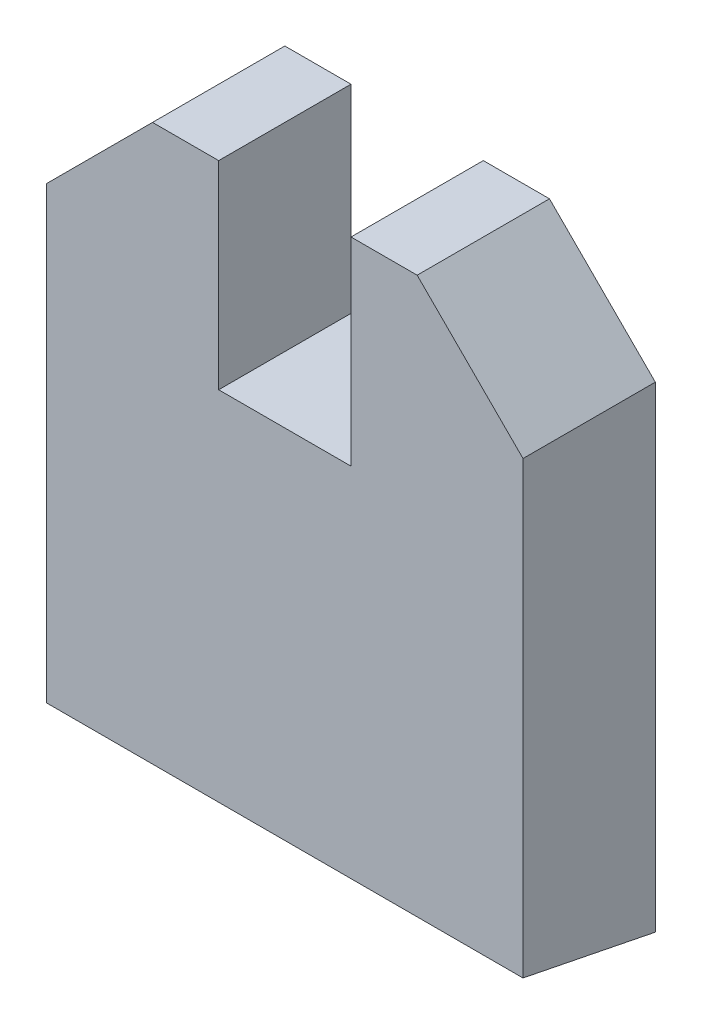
ISO-10303-21;
HEADER;
FILE_DESCRIPTION(('STEP AP214'),'2;1');
FILE_NAME('part.step','',(''),(''),'','','');
FILE_SCHEMA(('AUTOMOTIVE_DESIGN { 1 0 10303 214 1 1 1 1 }'));
ENDSEC;
DATA;
#1=APPLICATION_CONTEXT('core data for automotive mechanical design processes');
#2=APPLICATION_PROTOCOL_DEFINITION('international standard','automotive_design',2000,#1);
#3=PRODUCT_CONTEXT('',#1,'mechanical');
#4=PRODUCT('Part','Part','',(#3));
#5=PRODUCT_RELATED_PRODUCT_CATEGORY('part','',(#4));
#6=PRODUCT_DEFINITION_FORMATION('','',#4);
#7=PRODUCT_DEFINITION_CONTEXT('part definition',#1,'design');
#8=PRODUCT_DEFINITION('design','',#6,#7);
#9=PRODUCT_DEFINITION_SHAPE('','',#8);
#10=(LENGTH_UNIT() NAMED_UNIT(*) SI_UNIT(.MILLI.,.METRE.));
#11=(NAMED_UNIT(*) PLANE_ANGLE_UNIT() SI_UNIT($,.RADIAN.));
#12=(NAMED_UNIT(*) SI_UNIT($,.STERADIAN.) SOLID_ANGLE_UNIT());
#13=UNCERTAINTY_MEASURE_WITH_UNIT(LENGTH_MEASURE(1.E-05),#10,'distance_accuracy_value','');
#14=(GEOMETRIC_REPRESENTATION_CONTEXT(3) GLOBAL_UNCERTAINTY_ASSIGNED_CONTEXT((#13)) GLOBAL_UNIT_ASSIGNED_CONTEXT((#10,
#11,#12)) REPRESENTATION_CONTEXT('',''));
#15=CARTESIAN_POINT('',(0.,0.,0.));
#16=DIRECTION('',(0.,0.,1.));
#17=DIRECTION('',(1.,0.,0.));
#18=AXIS2_PLACEMENT_3D('',#15,#16,#17);
#19=CARTESIAN_POINT('',(9.,0.,5.));
#20=DIRECTION('',(-1.,0.,0.));
#21=DIRECTION('',(0.,-1.,0.));
#22=AXIS2_PLACEMENT_3D('',#19,#20,#21);
#23=PLANE('',#22);
#24=DIRECTION('',(0.,1.,0.));
#25=VECTOR('',#24,1.);
#26=CARTESIAN_POINT('',(9.,0.,5.));
#27=LINE('',#26,#25);
#28=CARTESIAN_POINT('',(9.,1.,5.));
#29=VERTEX_POINT('',#28);
#30=CARTESIAN_POINT('',(9.,18.,5.));
#31=VERTEX_POINT('',#30);
#32=EDGE_CURVE('E94',#29,#31,#27,.T.);
#33=ORIENTED_EDGE('',*,*,#32,.F.);
#34=DIRECTION('',(0.,0.196116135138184,0.98058067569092));
#35=VECTOR('',#34,1.);
#36=CARTESIAN_POINT('',(9.,0.,0.));
#37=LINE('',#36,#35);
#38=CARTESIAN_POINT('',(9.,0.,0.));
#39=VERTEX_POINT('',#38);
#40=EDGE_CURVE('E197',#39,#29,#37,.T.);
#41=ORIENTED_EDGE('',*,*,#40,.F.);
#42=DIRECTION('',(0.,1.,0.));
#43=VECTOR('',#42,1.);
#44=CARTESIAN_POINT('',(9.,0.,0.));
#45=LINE('',#44,#43);
#46=CARTESIAN_POINT('',(9.,18.,0.));
#47=VERTEX_POINT('',#46);
#48=EDGE_CURVE('E141',#39,#47,#45,.T.);
#49=ORIENTED_EDGE('',*,*,#48,.T.);
#50=DIRECTION('',(0.,0.,-1.));
#51=VECTOR('',#50,1.);
#52=CARTESIAN_POINT('',(9.,18.,5.));
#53=LINE('',#52,#51);
#54=EDGE_CURVE('E11',#31,#47,#53,.T.);
#55=ORIENTED_EDGE('',*,*,#54,.F.);
#56=EDGE_LOOP('',(#33,#41,#49,#55));
#57=FACE_BOUND('',#56,.T.);
#58=ADVANCED_FACE('F30',(#57),#23,.F.);
#59=CARTESIAN_POINT('',(9.,18.,5.));
#60=DIRECTION('',(-0.707106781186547,-0.707106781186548,0.));
#61=DIRECTION('',(0.707106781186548,-0.707106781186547,0.));
#62=AXIS2_PLACEMENT_3D('',#59,#60,#61);
#63=PLANE('',#62);
#64=DIRECTION('',(-0.707106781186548,0.707106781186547,0.));
#65=VECTOR('',#64,1.);
#66=CARTESIAN_POINT('',(9.,18.,0.));
#67=LINE('',#66,#65);
#68=CARTESIAN_POINT('',(4.99999999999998,22.,0.));
#69=VERTEX_POINT('',#68);
#70=EDGE_CURVE('E144',#47,#69,#67,.T.);
#71=ORIENTED_EDGE('',*,*,#70,.T.);
#72=DIRECTION('',(0.,0.,-1.));
#73=VECTOR('',#72,1.);
#74=CARTESIAN_POINT('',(4.99999999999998,22.,5.));
#75=LINE('',#74,#73);
#76=CARTESIAN_POINT('',(4.99999999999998,22.,5.));
#77=VERTEX_POINT('',#76);
#78=EDGE_CURVE('E38',#77,#69,#75,.T.);
#79=ORIENTED_EDGE('',*,*,#78,.F.);
#80=DIRECTION('',(-0.707106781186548,0.707106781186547,0.));
#81=VECTOR('',#80,1.);
#82=CARTESIAN_POINT('',(9.,18.,5.));
#83=LINE('',#82,#81);
#84=EDGE_CURVE('E193',#31,#77,#83,.T.);
#85=ORIENTED_EDGE('',*,*,#84,.F.);
#86=ORIENTED_EDGE('',*,*,#54,.T.);
#87=EDGE_LOOP('',(#71,#79,#85,#86));
#88=FACE_BOUND('',#87,.T.);
#89=ADVANCED_FACE('F210',(#88),#63,.F.);
#90=CARTESIAN_POINT('',(4.99999999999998,22.,5.));
#91=DIRECTION('',(0.,-1.,0.));
#92=DIRECTION('',(0.,0.,-1.));
#93=AXIS2_PLACEMENT_3D('',#90,#91,#92);
#94=PLANE('',#93);
#95=DIRECTION('',(-1.,0.,0.));
#96=VECTOR('',#95,1.);
#97=CARTESIAN_POINT('',(4.99999999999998,22.,0.));
#98=LINE('',#97,#96);
#99=CARTESIAN_POINT('',(2.5,22.,0.));
#100=VERTEX_POINT('',#99);
#101=EDGE_CURVE('E147',#69,#100,#98,.T.);
#102=ORIENTED_EDGE('',*,*,#101,.T.);
#103=DIRECTION('',(0.,0.,-1.));
#104=VECTOR('',#103,1.);
#105=CARTESIAN_POINT('',(2.5,22.,5.));
#106=LINE('',#105,#104);
#107=CARTESIAN_POINT('',(2.5,22.,5.));
#108=VERTEX_POINT('',#107);
#109=EDGE_CURVE('E167',#108,#100,#106,.T.);
#110=ORIENTED_EDGE('',*,*,#109,.F.);
#111=DIRECTION('',(-1.,0.,0.));
#112=VECTOR('',#111,1.);
#113=CARTESIAN_POINT('',(4.99999999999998,22.,5.));
#114=LINE('',#113,#112);
#115=EDGE_CURVE('E176',#77,#108,#114,.T.);
#116=ORIENTED_EDGE('',*,*,#115,.F.);
#117=ORIENTED_EDGE('',*,*,#78,.T.);
#118=EDGE_LOOP('',(#102,#110,#116,#117));
#119=FACE_BOUND('',#118,.T.);
#120=ADVANCED_FACE('F174',(#119),#94,.F.);
#121=CARTESIAN_POINT('',(2.5,22.,5.));
#122=DIRECTION('',(1.,0.,0.));
#123=DIRECTION('',(0.,1.,0.));
#124=AXIS2_PLACEMENT_3D('',#121,#122,#123);
#125=PLANE('',#124);
#126=DIRECTION('',(0.,-1.,0.));
#127=VECTOR('',#126,1.);
#128=CARTESIAN_POINT('',(2.5,22.,0.));
#129=LINE('',#128,#127);
#130=CARTESIAN_POINT('',(2.5,14.5,0.));
#131=VERTEX_POINT('',#130);
#132=EDGE_CURVE('E149',#100,#131,#129,.T.);
#133=ORIENTED_EDGE('',*,*,#132,.T.);
#134=DIRECTION('',(0.,0.,-1.));
#135=VECTOR('',#134,1.);
#136=CARTESIAN_POINT('',(2.5,14.5,5.));
#137=LINE('',#136,#135);
#138=CARTESIAN_POINT('',(2.5,14.5,5.));
#139=VERTEX_POINT('',#138);
#140=EDGE_CURVE('E164',#139,#131,#137,.T.);
#141=ORIENTED_EDGE('',*,*,#140,.F.);
#142=DIRECTION('',(0.,-1.,0.));
#143=VECTOR('',#142,1.);
#144=CARTESIAN_POINT('',(2.5,22.,5.));
#145=LINE('',#144,#143);
#146=EDGE_CURVE('E189',#108,#139,#145,.T.);
#147=ORIENTED_EDGE('',*,*,#146,.F.);
#148=ORIENTED_EDGE('',*,*,#109,.T.);
#149=EDGE_LOOP('',(#133,#141,#147,#148));
#150=FACE_BOUND('',#149,.T.);
#151=ADVANCED_FACE('F185',(#150),#125,.F.);
#152=CARTESIAN_POINT('',(2.5,14.5,5.));
#153=DIRECTION('',(0.,-1.,0.));
#154=DIRECTION('',(0.,0.,-1.));
#155=AXIS2_PLACEMENT_3D('',#152,#153,#154);
#156=PLANE('',#155);
#157=DIRECTION('',(-1.,0.,0.));
#158=VECTOR('',#157,1.);
#159=CARTESIAN_POINT('',(2.5,14.5,0.));
#160=LINE('',#159,#158);
#161=CARTESIAN_POINT('',(-2.5,14.5,0.));
#162=VERTEX_POINT('',#161);
#163=EDGE_CURVE('E151',#131,#162,#160,.T.);
#164=ORIENTED_EDGE('',*,*,#163,.T.);
#165=DIRECTION('',(0.,0.,-1.));
#166=VECTOR('',#165,1.);
#167=CARTESIAN_POINT('',(-2.5,14.5,5.));
#168=LINE('',#167,#166);
#169=CARTESIAN_POINT('',(-2.5,14.5,5.));
#170=VERTEX_POINT('',#169);
#171=EDGE_CURVE('E130',#170,#162,#168,.T.);
#172=ORIENTED_EDGE('',*,*,#171,.F.);
#173=DIRECTION('',(-1.,0.,0.));
#174=VECTOR('',#173,1.);
#175=CARTESIAN_POINT('',(2.5,14.5,5.));
#176=LINE('',#175,#174);
#177=EDGE_CURVE('E118',#139,#170,#176,.T.);
#178=ORIENTED_EDGE('',*,*,#177,.F.);
#179=ORIENTED_EDGE('',*,*,#140,.T.);
#180=EDGE_LOOP('',(#164,#172,#178,#179));
#181=FACE_BOUND('',#180,.T.);
#182=ADVANCED_FACE('F188',(#181),#156,.F.);
#183=CARTESIAN_POINT('',(-2.5,22.,5.));
#184=DIRECTION('',(-1.,0.,0.));
#185=DIRECTION('',(0.,-1.,0.));
#186=AXIS2_PLACEMENT_3D('',#183,#184,#185);
#187=PLANE('',#186);
#188=DIRECTION('',(0.,1.,0.));
#189=VECTOR('',#188,1.);
#190=CARTESIAN_POINT('',(-2.5,22.,0.));
#191=LINE('',#190,#189);
#192=CARTESIAN_POINT('',(-2.5,22.,0.));
#193=VERTEX_POINT('',#192);
#194=EDGE_CURVE('E127',#162,#193,#191,.T.);
#195=ORIENTED_EDGE('',*,*,#194,.T.);
#196=DIRECTION('',(0.,0.,-1.));
#197=VECTOR('',#196,1.);
#198=CARTESIAN_POINT('',(-2.5,22.,5.));
#199=LINE('',#198,#197);
#200=CARTESIAN_POINT('',(-2.5,22.,5.));
#201=VERTEX_POINT('',#200);
#202=EDGE_CURVE('E124',#201,#193,#199,.T.);
#203=ORIENTED_EDGE('',*,*,#202,.F.);
#204=DIRECTION('',(0.,1.,0.));
#205=VECTOR('',#204,1.);
#206=CARTESIAN_POINT('',(-2.5,22.,5.));
#207=LINE('',#206,#205);
#208=EDGE_CURVE('E111',#170,#201,#207,.T.);
#209=ORIENTED_EDGE('',*,*,#208,.F.);
#210=ORIENTED_EDGE('',*,*,#171,.T.);
#211=EDGE_LOOP('',(#195,#203,#209,#210));
#212=FACE_BOUND('',#211,.T.);
#213=ADVANCED_FACE('F125',(#212),#187,.F.);
#214=CARTESIAN_POINT('',(-4.99999999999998,22.,5.));
#215=DIRECTION('',(0.,-1.,0.));
#216=DIRECTION('',(0.,0.,-1.));
#217=AXIS2_PLACEMENT_3D('',#214,#215,#216);
#218=PLANE('',#217);
#219=DIRECTION('',(-1.,0.,0.));
#220=VECTOR('',#219,1.);
#221=CARTESIAN_POINT('',(-4.99999999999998,22.,0.));
#222=LINE('',#221,#220);
#223=CARTESIAN_POINT('',(-4.99999999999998,22.,0.));
#224=VERTEX_POINT('',#223);
#225=EDGE_CURVE('E154',#193,#224,#222,.T.);
#226=ORIENTED_EDGE('',*,*,#225,.T.);
#227=DIRECTION('',(0.,0.,-1.));
#228=VECTOR('',#227,1.);
#229=CARTESIAN_POINT('',(-4.99999999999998,22.,5.));
#230=LINE('',#229,#228);
#231=CARTESIAN_POINT('',(-4.99999999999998,22.,5.));
#232=VERTEX_POINT('',#231);
#233=EDGE_CURVE('E131',#232,#224,#230,.T.);
#234=ORIENTED_EDGE('',*,*,#233,.F.);
#235=DIRECTION('',(-1.,0.,0.));
#236=VECTOR('',#235,1.);
#237=CARTESIAN_POINT('',(-4.99999999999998,22.,5.));
#238=LINE('',#237,#236);
#239=EDGE_CURVE('E115',#201,#232,#238,.T.);
#240=ORIENTED_EDGE('',*,*,#239,.F.);
#241=ORIENTED_EDGE('',*,*,#202,.T.);
#242=EDGE_LOOP('',(#226,#234,#240,#241));
#243=FACE_BOUND('',#242,.T.);
#244=ADVANCED_FACE('F133',(#243),#218,.F.);
#245=CARTESIAN_POINT('',(-9.,18.,5.));
#246=DIRECTION('',(0.707106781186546,-0.707106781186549,0.));
#247=DIRECTION('',(0.707106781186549,0.707106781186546,0.));
#248=AXIS2_PLACEMENT_3D('',#245,#246,#247);
#249=PLANE('',#248);
#250=DIRECTION('',(-0.707106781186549,-0.707106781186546,0.));
#251=VECTOR('',#250,1.);
#252=CARTESIAN_POINT('',(-9.,18.,0.));
#253=LINE('',#252,#251);
#254=CARTESIAN_POINT('',(-9.,18.,0.));
#255=VERTEX_POINT('',#254);
#256=EDGE_CURVE('E78',#224,#255,#253,.T.);
#257=ORIENTED_EDGE('',*,*,#256,.T.);
#258=DIRECTION('',(0.,0.,-1.));
#259=VECTOR('',#258,1.);
#260=CARTESIAN_POINT('',(-9.,18.,5.));
#261=LINE('',#260,#259);
#262=CARTESIAN_POINT('',(-9.,18.,5.));
#263=VERTEX_POINT('',#262);
#264=EDGE_CURVE('E140',#263,#255,#261,.T.);
#265=ORIENTED_EDGE('',*,*,#264,.F.);
#266=DIRECTION('',(-0.707106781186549,-0.707106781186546,0.));
#267=VECTOR('',#266,1.);
#268=CARTESIAN_POINT('',(-9.,18.,5.));
#269=LINE('',#268,#267);
#270=EDGE_CURVE('E46',#232,#263,#269,.T.);
#271=ORIENTED_EDGE('',*,*,#270,.F.);
#272=ORIENTED_EDGE('',*,*,#233,.T.);
#273=EDGE_LOOP('',(#257,#265,#271,#272));
#274=FACE_BOUND('',#273,.T.);
#275=ADVANCED_FACE('F226',(#274),#249,.F.);
#276=CARTESIAN_POINT('',(-9.,0.,5.));
#277=DIRECTION('',(1.,0.,0.));
#278=DIRECTION('',(0.,1.,0.));
#279=AXIS2_PLACEMENT_3D('',#276,#277,#278);
#280=PLANE('',#279);
#281=DIRECTION('',(0.,-1.,0.));
#282=VECTOR('',#281,1.);
#283=CARTESIAN_POINT('',(-9.,0.,0.));
#284=LINE('',#283,#282);
#285=CARTESIAN_POINT('',(-9.,0.,0.));
#286=VERTEX_POINT('',#285);
#287=EDGE_CURVE('E157',#255,#286,#284,.T.);
#288=ORIENTED_EDGE('',*,*,#287,.T.);
#289=DIRECTION('',(0.,0.196116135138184,0.98058067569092));
#290=VECTOR('',#289,1.);
#291=CARTESIAN_POINT('',(-9.,0.,0.));
#292=LINE('',#291,#290);
#293=CARTESIAN_POINT('',(-9.,0.999999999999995,5.));
#294=VERTEX_POINT('',#293);
#295=EDGE_CURVE('E86',#286,#294,#292,.T.);
#296=ORIENTED_EDGE('',*,*,#295,.T.);
#297=DIRECTION('',(0.,-1.,0.));
#298=VECTOR('',#297,1.);
#299=CARTESIAN_POINT('',(-9.,0.,5.));
#300=LINE('',#299,#298);
#301=EDGE_CURVE('E135',#263,#294,#300,.T.);
#302=ORIENTED_EDGE('',*,*,#301,.F.);
#303=ORIENTED_EDGE('',*,*,#264,.T.);
#304=EDGE_LOOP('',(#288,#296,#302,#303));
#305=FACE_BOUND('',#304,.T.);
#306=ADVANCED_FACE('F202',(#305),#280,.F.);
#307=CARTESIAN_POINT('',(8.99999999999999,22.,5.));
#308=DIRECTION('',(0.,0.,1.));
#309=DIRECTION('',(1.,0.,0.));
#310=AXIS2_PLACEMENT_3D('',#307,#308,#309);
#311=PLANE('',#310);
#312=DIRECTION('',(1.,0.,0.));
#313=VECTOR('',#312,1.);
#314=CARTESIAN_POINT('',(-9.,0.999999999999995,5.));
#315=LINE('',#314,#313);
#316=EDGE_CURVE('E145',#294,#29,#315,.T.);
#317=ORIENTED_EDGE('',*,*,#316,.T.);
#318=ORIENTED_EDGE('',*,*,#32,.T.);
#319=ORIENTED_EDGE('',*,*,#84,.T.);
#320=ORIENTED_EDGE('',*,*,#115,.T.);
#321=ORIENTED_EDGE('',*,*,#146,.T.);
#322=ORIENTED_EDGE('',*,*,#177,.T.);
#323=ORIENTED_EDGE('',*,*,#208,.T.);
#324=ORIENTED_EDGE('',*,*,#239,.T.);
#325=ORIENTED_EDGE('',*,*,#270,.T.);
#326=ORIENTED_EDGE('',*,*,#301,.T.);
#327=EDGE_LOOP('',(#317,#318,#319,#320,#321,#322,#323,#324,#325,#326));
#328=FACE_BOUND('',#327,.T.);
#329=ADVANCED_FACE('F113',(#328),#311,.T.);
#330=CARTESIAN_POINT('',(8.99999999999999,22.,0.));
#331=DIRECTION('',(0.,0.,1.));
#332=DIRECTION('',(1.,0.,0.));
#333=AXIS2_PLACEMENT_3D('',#330,#331,#332);
#334=PLANE('',#333);
#335=ORIENTED_EDGE('',*,*,#48,.F.);
#336=DIRECTION('',(1.,0.,0.));
#337=VECTOR('',#336,1.);
#338=CARTESIAN_POINT('',(-9.,0.,0.));
#339=LINE('',#338,#337);
#340=EDGE_CURVE('E159',#286,#39,#339,.T.);
#341=ORIENTED_EDGE('',*,*,#340,.F.);
#342=ORIENTED_EDGE('',*,*,#287,.F.);
#343=ORIENTED_EDGE('',*,*,#256,.F.);
#344=ORIENTED_EDGE('',*,*,#225,.F.);
#345=ORIENTED_EDGE('',*,*,#194,.F.);
#346=ORIENTED_EDGE('',*,*,#163,.F.);
#347=ORIENTED_EDGE('',*,*,#132,.F.);
#348=ORIENTED_EDGE('',*,*,#101,.F.);
#349=ORIENTED_EDGE('',*,*,#70,.F.);
#350=EDGE_LOOP('',(#335,#341,#342,#343,#344,#345,#346,#347,#348,#349));
#351=FACE_BOUND('',#350,.T.);
#352=ADVANCED_FACE('F181',(#351),#334,.F.);
#353=CARTESIAN_POINT('',(-9.,0.,0.));
#354=DIRECTION('',(0.,0.98058067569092,-0.196116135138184));
#355=DIRECTION('',(0.,0.196116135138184,0.98058067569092));
#356=AXIS2_PLACEMENT_3D('',#353,#354,#355);
#357=PLANE('',#356);
#358=ORIENTED_EDGE('',*,*,#40,.T.);
#359=ORIENTED_EDGE('',*,*,#316,.F.);
#360=ORIENTED_EDGE('',*,*,#295,.F.);
#361=ORIENTED_EDGE('',*,*,#340,.T.);
#362=EDGE_LOOP('',(#358,#359,#360,#361));
#363=FACE_BOUND('',#362,.T.);
#364=ADVANCED_FACE('F233',(#363),#357,.F.);
#365=CLOSED_SHELL('',(#58,#89,#120,#151,#182,#213,#244,#275,#306,#329,#352,#364));
#366=MANIFOLD_SOLID_BREP('B2',#365);
#367=ADVANCED_BREP_SHAPE_REPRESENTATION('',(#18,#366),#14);
#368=SHAPE_DEFINITION_REPRESENTATION(#9,#367);
ENDSEC;
END-ISO-10303-21;
